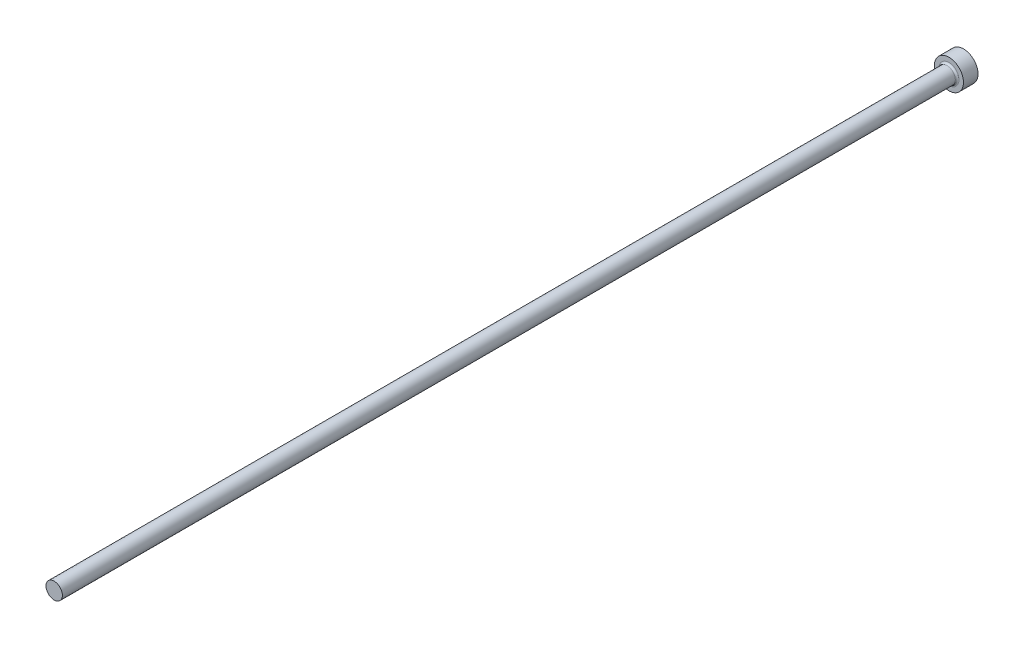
ISO-10303-21;
HEADER;
FILE_DESCRIPTION(('STEP AP214'),'2;1');
FILE_NAME('part.step','',(''),(''),'','','');
FILE_SCHEMA(('AUTOMOTIVE_DESIGN { 1 0 10303 214 1 1 1 1 }'));
ENDSEC;
DATA;
#1=APPLICATION_CONTEXT('core data for automotive mechanical design processes');
#2=APPLICATION_PROTOCOL_DEFINITION('international standard','automotive_design',2000,#1);
#3=PRODUCT_CONTEXT('',#1,'mechanical');
#4=PRODUCT('Part','Part','',(#3));
#5=PRODUCT_RELATED_PRODUCT_CATEGORY('part','',(#4));
#6=PRODUCT_DEFINITION_FORMATION('','',#4);
#7=PRODUCT_DEFINITION_CONTEXT('part definition',#1,'design');
#8=PRODUCT_DEFINITION('design','',#6,#7);
#9=PRODUCT_DEFINITION_SHAPE('','',#8);
#10=(LENGTH_UNIT() NAMED_UNIT(*) SI_UNIT(.MILLI.,.METRE.));
#11=(NAMED_UNIT(*) PLANE_ANGLE_UNIT() SI_UNIT($,.RADIAN.));
#12=(NAMED_UNIT(*) SI_UNIT($,.STERADIAN.) SOLID_ANGLE_UNIT());
#13=UNCERTAINTY_MEASURE_WITH_UNIT(LENGTH_MEASURE(1.E-05),#10,'distance_accuracy_value','');
#14=(GEOMETRIC_REPRESENTATION_CONTEXT(3) GLOBAL_UNCERTAINTY_ASSIGNED_CONTEXT((#13)) GLOBAL_UNIT_ASSIGNED_CONTEXT((#10,
#11,#12)) REPRESENTATION_CONTEXT('',''));
#15=CARTESIAN_POINT('',(0.,0.,0.));
#16=DIRECTION('',(0.,0.,1.));
#17=DIRECTION('',(1.,0.,0.));
#18=AXIS2_PLACEMENT_3D('',#15,#16,#17);
#19=CARTESIAN_POINT('',(4.,0.,4.));
#20=DIRECTION('',(0.,0.,-1.));
#21=DIRECTION('',(-1.,0.,0.));
#22=AXIS2_PLACEMENT_3D('',#19,#20,#21);
#23=PLANE('',#22);
#24=CARTESIAN_POINT('',(0.,0.,4.));
#25=DIRECTION('',(0.,0.,-1.));
#26=DIRECTION('',(-1.,0.,0.));
#27=AXIS2_PLACEMENT_3D('',#24,#25,#26);
#28=CIRCLE('',#27,2.75000000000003);
#29=CARTESIAN_POINT('',(-2.75000000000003,0.,4.));
#30=VERTEX_POINT('',#29);
#31=EDGE_CURVE('E40',#30,#30,#28,.T.);
#32=ORIENTED_EDGE('',*,*,#31,.T.);
#33=EDGE_LOOP('',(#32));
#34=FACE_BOUND('',#33,.T.);
#35=CARTESIAN_POINT('',(0.,0.,4.));
#36=DIRECTION('',(0.,0.,-1.));
#37=DIRECTION('',(-1.,0.,0.));
#38=AXIS2_PLACEMENT_3D('',#35,#36,#37);
#39=CIRCLE('',#38,4.);
#40=CARTESIAN_POINT('',(-4.,0.,4.));
#41=VERTEX_POINT('',#40);
#42=EDGE_CURVE('E44',#41,#41,#39,.T.);
#43=ORIENTED_EDGE('',*,*,#42,.F.);
#44=EDGE_LOOP('',(#43));
#45=FACE_BOUND('',#44,.T.);
#46=ADVANCED_FACE('F33',(#34,#45),#23,.F.);
#47=CARTESIAN_POINT('',(0.,0.,-9.03322817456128));
#48=DIRECTION('',(0.,0.,-1.));
#49=DIRECTION('',(-1.,0.,0.));
#50=AXIS2_PLACEMENT_3D('',#47,#48,#49);
#51=CYLINDRICAL_SURFACE('',#50,4.);
#52=CARTESIAN_POINT('',(0.,0.,0.));
#53=DIRECTION('',(0.,0.,-1.));
#54=DIRECTION('',(-1.,0.,0.));
#55=AXIS2_PLACEMENT_3D('',#52,#53,#54);
#56=CIRCLE('',#55,4.);
#57=CARTESIAN_POINT('',(-4.,0.,0.));
#58=VERTEX_POINT('',#57);
#59=EDGE_CURVE('E48',#58,#58,#56,.T.);
#60=ORIENTED_EDGE('',*,*,#59,.F.);
#61=EDGE_LOOP('',(#60));
#62=FACE_BOUND('',#61,.T.);
#63=ORIENTED_EDGE('',*,*,#42,.T.);
#64=EDGE_LOOP('',(#63));
#65=FACE_BOUND('',#64,.T.);
#66=ADVANCED_FACE('F68',(#62,#65),#51,.T.);
#67=CARTESIAN_POINT('',(0.,0.,0.));
#68=DIRECTION('',(0.,0.,1.));
#69=DIRECTION('',(1.,0.,0.));
#70=AXIS2_PLACEMENT_3D('',#67,#68,#69);
#71=PLANE('',#70);
#72=ORIENTED_EDGE('',*,*,#59,.T.);
#73=EDGE_LOOP('',(#72));
#74=FACE_BOUND('',#73,.T.);
#75=ADVANCED_FACE('F61',(#74),#71,.F.);
#76=CARTESIAN_POINT('',(0.,0.,250.));
#77=DIRECTION('',(0.,0.,-1.));
#78=DIRECTION('',(-1.,0.,0.));
#79=AXIS2_PLACEMENT_3D('',#76,#77,#78);
#80=PLANE('',#79);
#81=CARTESIAN_POINT('',(0.,0.,250.));
#82=DIRECTION('',(0.,0.,-1.));
#83=DIRECTION('',(-1.,0.,0.));
#84=AXIS2_PLACEMENT_3D('',#81,#82,#83);
#85=CIRCLE('',#84,2.25000000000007);
#86=CARTESIAN_POINT('',(-2.25000000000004,0.,250.));
#87=VERTEX_POINT('',#86);
#88=EDGE_CURVE('E53',#87,#87,#85,.T.);
#89=ORIENTED_EDGE('',*,*,#88,.F.);
#90=EDGE_LOOP('',(#89));
#91=FACE_BOUND('',#90,.T.);
#92=ADVANCED_FACE('F59',(#91),#80,.F.);
#93=CARTESIAN_POINT('',(0.,0.,-9.03322817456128));
#94=DIRECTION('',(0.,0.,-1.));
#95=DIRECTION('',(-1.,0.,0.));
#96=AXIS2_PLACEMENT_3D('',#93,#94,#95);
#97=CYLINDRICAL_SURFACE('',#96,2.25000000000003);
#98=CARTESIAN_POINT('',(0.,0.,4.5));
#99=DIRECTION('',(0.,0.,-1.));
#100=DIRECTION('',(-1.,0.,0.));
#101=AXIS2_PLACEMENT_3D('',#98,#99,#100);
#102=CIRCLE('',#101,2.25000000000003);
#103=CARTESIAN_POINT('',(-2.25000000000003,0.,4.5));
#104=VERTEX_POINT('',#103);
#105=EDGE_CURVE('E10',#104,#104,#102,.F.);
#106=ORIENTED_EDGE('',*,*,#105,.T.);
#107=EDGE_LOOP('',(#106));
#108=FACE_BOUND('',#107,.T.);
#109=ORIENTED_EDGE('',*,*,#88,.T.);
#110=EDGE_LOOP('',(#109));
#111=FACE_BOUND('',#110,.T.);
#112=ADVANCED_FACE('F57',(#108,#111),#97,.T.);
#113=CARTESIAN_POINT('',(0.,0.,4.5));
#114=DIRECTION('',(0.,0.,-1.));
#115=DIRECTION('',(-1.,0.,0.));
#116=AXIS2_PLACEMENT_3D('',#113,#114,#115);
#117=TOROIDAL_SURFACE('',#116,2.75000000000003,0.5);
#118=ORIENTED_EDGE('',*,*,#105,.F.);
#119=EDGE_LOOP('',(#118));
#120=FACE_BOUND('',#119,.T.);
#121=ORIENTED_EDGE('',*,*,#31,.F.);
#122=EDGE_LOOP('',(#121));
#123=FACE_BOUND('',#122,.T.);
#124=ADVANCED_FACE('F35',(#120,#123),#117,.F.);
#125=CLOSED_SHELL('',(#46,#66,#75,#92,#112,#124));
#126=MANIFOLD_SOLID_BREP('B2',#125);
#127=ADVANCED_BREP_SHAPE_REPRESENTATION('',(#18,#126),#14);
#128=SHAPE_DEFINITION_REPRESENTATION(#9,#127);
ENDSEC;
END-ISO-10303-21;
